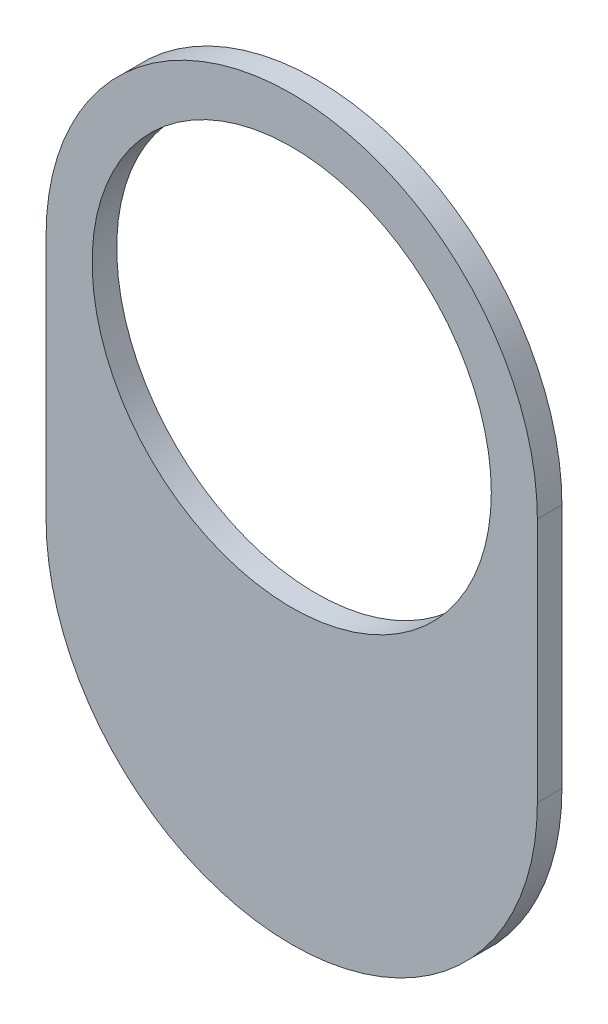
from build123d import *

# Parameters (mm, degrees)
ESQUISSE1_R        = 16.25
BOSS_EXTRU_1_DEPTH = 1


with BuildPart() as part:
    # Esquisse1 → Boss.-Extru.1 (new, symmetric)
    with BuildSketch(Plane.XY):
        with BuildLine():
            Line((-20, 0), (-20, -20))
            ThreePointArc((-20, -20), (0, -40), (20, -20))
            Line((20, -20), (20, 0))
            ThreePointArc((20, 0), (0, 20), (-20, 0))
        make_face()
        Circle(ESQUISSE1_R, mode=Mode.SUBTRACT)
    extrude(amount=BOSS_EXTRU_1_DEPTH, both=True)


solid = part.part
